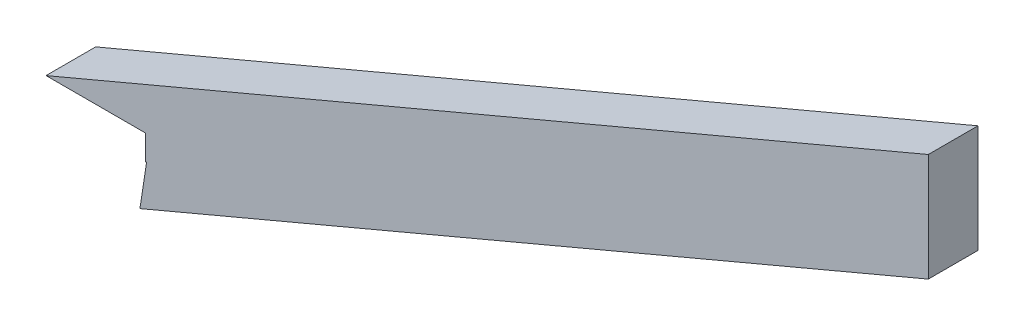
from build123d import *

# Parameters (mm, degrees)
BOSS_EXTRUDE2_DEPTH = 50.8


with BuildPart() as part:
    # Sketch1 → Boss-Extrude2 (new body)
    with BuildSketch(Plane.XY):
        Polygon((-914.4, 25.4), (-12.7, 406.4), (-12.7, 296.102635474), (-818.427035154, -44.345407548), (-811.604664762, 0), (-812.8, 0), (-812.8, 25.4), align=None)
    extrude(amount=BOSS_EXTRUDE2_DEPTH)


solid = part.part
